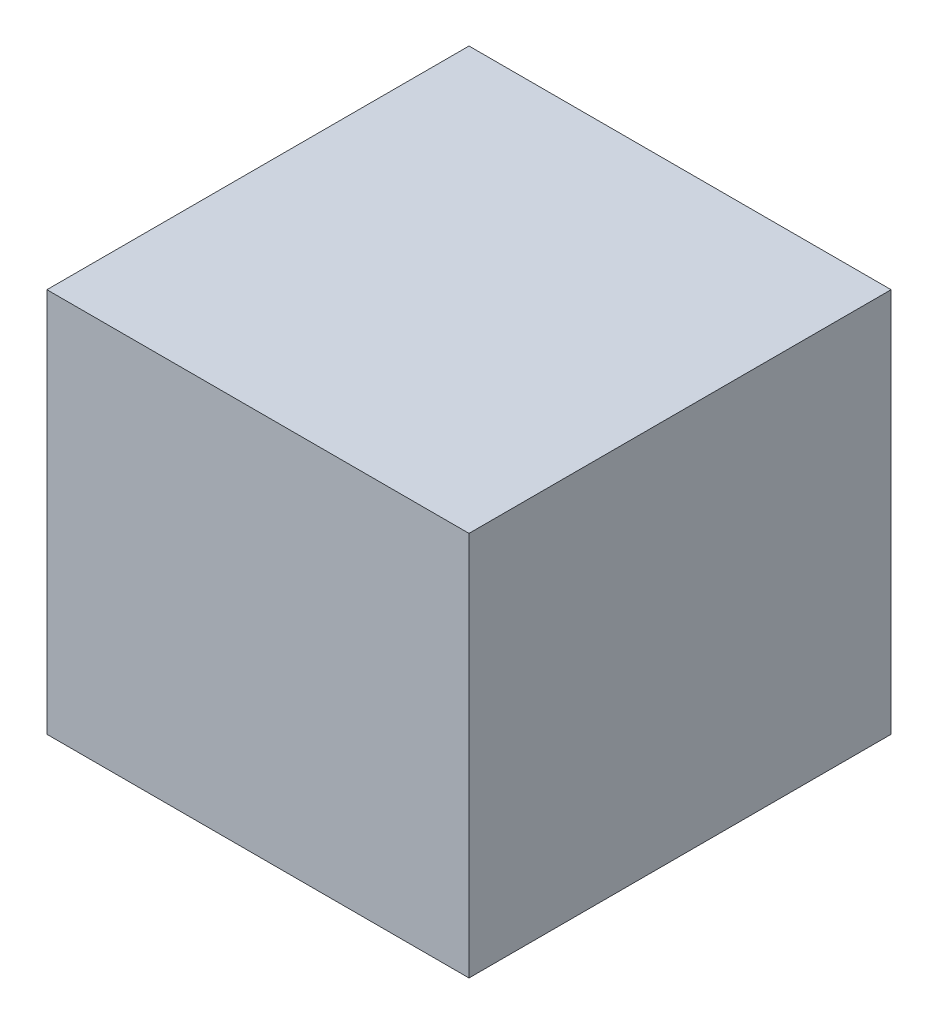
from build123d import *

# Parameters (mm, degrees)
SKETCH1_W      = 57
SKETCH1_H      = 57
EXTRUDE1_DEPTH = 52


with BuildPart() as part:
    # Sketch1 → Extrude1 (new body)
    with BuildSketch(Plane(origin=(0, 0, 0), x_dir=(1, 0, 0), z_dir=(0, 1, 0))):
        with Locations((28.5, 28.5)):
            Rectangle(SKETCH1_W, SKETCH1_H)
    extrude(amount=-EXTRUDE1_DEPTH)


solid = part.part
